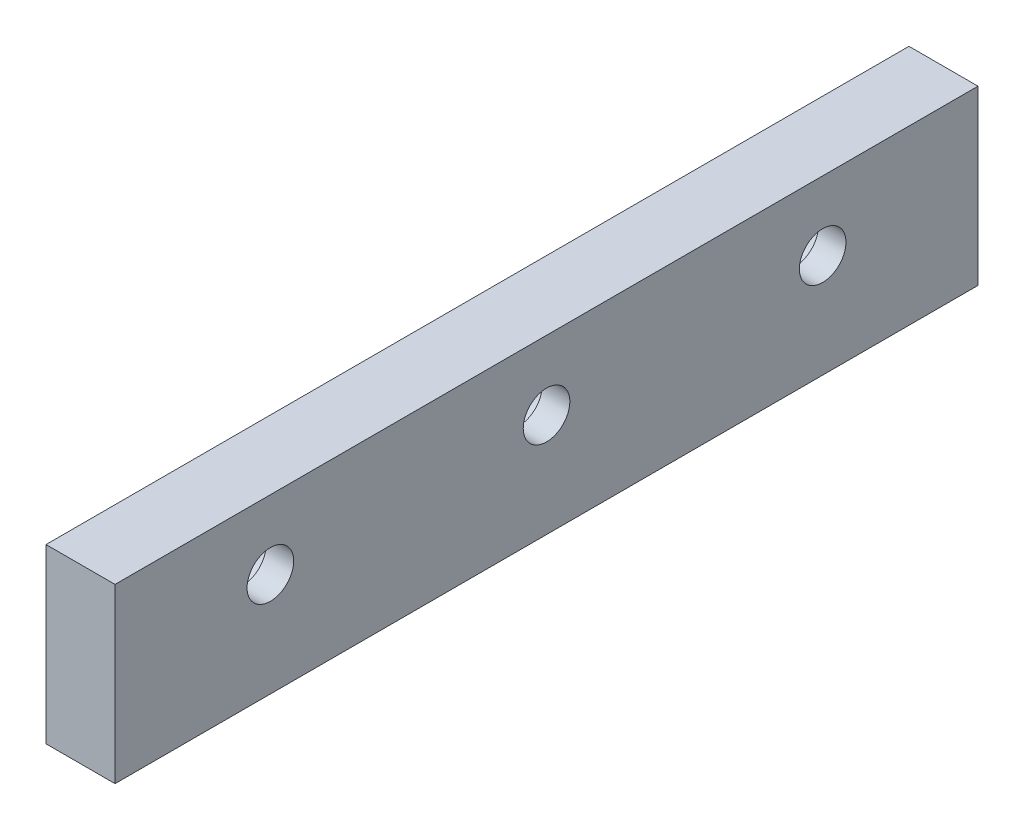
from build123d import *

# Parameters (mm, degrees)
ESQUISSE1_W                                        = 20
ESQUISSE1_H                                        = 50
BOSS_EXTRU_1_DEPTH                                 = 125
CHAMBRAGE_POUR_VIS_T_TE_HEXAGONALE_M12_D           = 13.5
CHAMBRAGE_POUR_VIS_T_TE_HEXAGONALE_M12_CBORE_D     = 20
CHAMBRAGE_POUR_VIS_T_TE_HEXAGONALE_M12_CBORE_DEPTH = 12


with BuildPart() as part:
    # Esquisse1 → Boss.-Extru.1 (new, symmetric)
    with BuildSketch(Plane.XY):
        with Locations((-10, -5)):
            Rectangle(ESQUISSE1_W, ESQUISSE1_H)
    extrude(amount=BOSS_EXTRU_1_DEPTH, both=True)

    # Chambrage pour vis _ t_te hexagonale M12 (through all)
    with Locations(Plane.ZY.offset(20)):
        with Locations((0, 0), (80, 0), (-80, 0)):
            CounterBoreHole(CHAMBRAGE_POUR_VIS_T_TE_HEXAGONALE_M12_D / 2, CHAMBRAGE_POUR_VIS_T_TE_HEXAGONALE_M12_CBORE_D / 2, CHAMBRAGE_POUR_VIS_T_TE_HEXAGONALE_M12_CBORE_DEPTH)


solid = part.part
